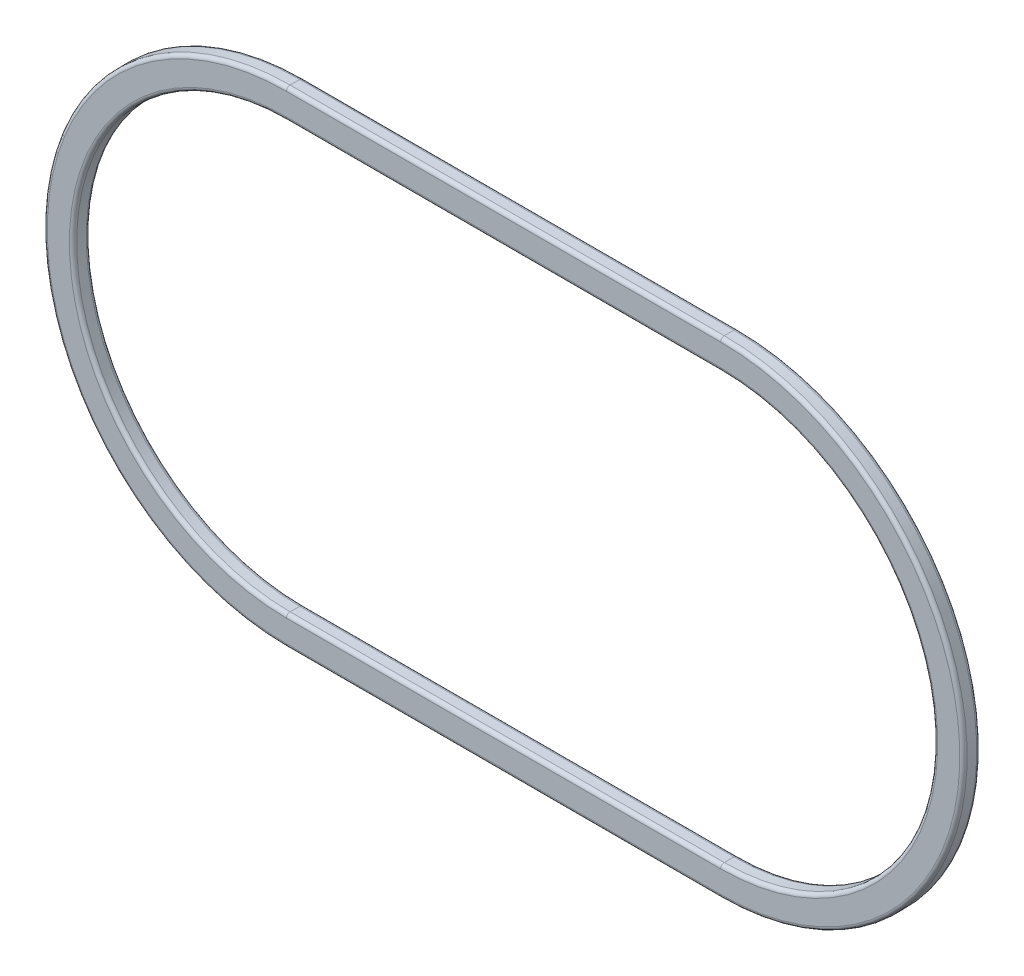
ISO-10303-21;
HEADER;
FILE_DESCRIPTION(('STEP AP214'),'2;1');
FILE_NAME('part.step','',(''),(''),'','','');
FILE_SCHEMA(('AUTOMOTIVE_DESIGN { 1 0 10303 214 1 1 1 1 }'));
ENDSEC;
DATA;
#1=APPLICATION_CONTEXT('core data for automotive mechanical design processes');
#2=APPLICATION_PROTOCOL_DEFINITION('international standard','automotive_design',2000,#1);
#3=PRODUCT_CONTEXT('',#1,'mechanical');
#4=PRODUCT('Part','Part','',(#3));
#5=PRODUCT_RELATED_PRODUCT_CATEGORY('part','',(#4));
#6=PRODUCT_DEFINITION_FORMATION('','',#4);
#7=PRODUCT_DEFINITION_CONTEXT('part definition',#1,'design');
#8=PRODUCT_DEFINITION('design','',#6,#7);
#9=PRODUCT_DEFINITION_SHAPE('','',#8);
#10=(LENGTH_UNIT() NAMED_UNIT(*) SI_UNIT(.MILLI.,.METRE.));
#11=(NAMED_UNIT(*) PLANE_ANGLE_UNIT() SI_UNIT($,.RADIAN.));
#12=(NAMED_UNIT(*) SI_UNIT($,.STERADIAN.) SOLID_ANGLE_UNIT());
#13=UNCERTAINTY_MEASURE_WITH_UNIT(LENGTH_MEASURE(1.E-05),#10,'distance_accuracy_value','');
#14=(GEOMETRIC_REPRESENTATION_CONTEXT(3) GLOBAL_UNCERTAINTY_ASSIGNED_CONTEXT((#13)) GLOBAL_UNIT_ASSIGNED_CONTEXT((#10,
#11,#12)) REPRESENTATION_CONTEXT('',''));
#15=CARTESIAN_POINT('',(0.,0.,0.));
#16=DIRECTION('',(0.,0.,1.));
#17=DIRECTION('',(1.,0.,0.));
#18=AXIS2_PLACEMENT_3D('',#15,#16,#17);
#19=CARTESIAN_POINT('',(0.,0.,0.));
#20=DIRECTION('',(0.,0.,-1.));
#21=DIRECTION('',(-1.,0.,0.));
#22=AXIS2_PLACEMENT_3D('',#19,#20,#21);
#23=CYLINDRICAL_SURFACE('',#22,33.);
#24=DIRECTION('',(0.,0.,1.));
#25=VECTOR('',#24,1.);
#26=CARTESIAN_POINT('',(-4.57966997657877E-13,-33.,3.28352476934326));
#27=LINE('',#26,#25);
#28=CARTESIAN_POINT('',(-4.57966997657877E-13,-33.,1.98352476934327));
#29=VERTEX_POINT('',#28);
#30=CARTESIAN_POINT('',(-4.57966997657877E-13,-33.,3.28352476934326));
#31=VERTEX_POINT('',#30);
#32=EDGE_CURVE('E477',#29,#31,#27,.T.);
#33=ORIENTED_EDGE('',*,*,#32,.T.);
#34=CARTESIAN_POINT('',(0.,0.,3.28352476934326));
#35=DIRECTION('',(0.,0.,-1.));
#36=DIRECTION('',(-1.,0.,0.));
#37=AXIS2_PLACEMENT_3D('',#34,#35,#36);
#38=CIRCLE('',#37,33.);
#39=CARTESIAN_POINT('',(0.,33.,3.28352476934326));
#40=VERTEX_POINT('',#39);
#41=EDGE_CURVE('E46',#31,#40,#38,.T.);
#42=ORIENTED_EDGE('',*,*,#41,.T.);
#43=CARTESIAN_POINT('',(0.,33.,1.98352476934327));
#44=DIRECTION('',(0.,0.,1.));
#45=VECTOR('',#44,1.);
#46=LINE('',#43,#45);
#47=CARTESIAN_POINT('',(4.53925663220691E-13,33.,1.98352476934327));
#48=VERTEX_POINT('',#47);
#49=EDGE_CURVE('E279',#48,#40,#46,.T.);
#50=ORIENTED_EDGE('',*,*,#49,.F.);
#51=CARTESIAN_POINT('',(0.,0.,1.98352476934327));
#52=DIRECTION('',(0.,0.,-1.));
#53=DIRECTION('',(-1.,0.,0.));
#54=AXIS2_PLACEMENT_3D('',#51,#52,#53);
#55=CIRCLE('',#54,33.);
#56=EDGE_CURVE('E11',#29,#48,#55,.T.);
#57=ORIENTED_EDGE('',*,*,#56,.F.);
#58=EDGE_LOOP('',(#33,#42,#50,#57));
#59=FACE_BOUND('',#58,.T.);
#60=ADVANCED_FACE('F37',(#59),#23,.T.);
#61=CARTESIAN_POINT('',(0.,0.,3.28352476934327));
#62=DIRECTION('',(0.,0.,-1.));
#63=DIRECTION('',(-1.,0.,0.));
#64=AXIS2_PLACEMENT_3D('',#61,#62,#63);
#65=TOROIDAL_SURFACE('',#64,32.5,0.5);
#66=CARTESIAN_POINT('',(-4.5102810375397E-13,-32.5,3.28352476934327));
#67=DIRECTION('',(-1.,0.,0.));
#68=DIRECTION('',(0.,0.,1.));
#69=AXIS2_PLACEMENT_3D('',#66,#67,#68);
#70=CIRCLE('',#69,0.5);
#71=CARTESIAN_POINT('',(-4.5102810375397E-13,-32.5,3.78352476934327));
#72=VERTEX_POINT('',#71);
#73=EDGE_CURVE('E483',#31,#72,#70,.T.);
#74=ORIENTED_EDGE('',*,*,#73,.T.);
#75=CARTESIAN_POINT('',(0.,0.,3.78352476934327));
#76=DIRECTION('',(0.,0.,-1.));
#77=DIRECTION('',(-1.,0.,0.));
#78=AXIS2_PLACEMENT_3D('',#75,#76,#77);
#79=CIRCLE('',#78,32.5);
#80=CARTESIAN_POINT('',(0.,32.5,3.78352476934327));
#81=VERTEX_POINT('',#80);
#82=EDGE_CURVE('E296',#72,#81,#79,.T.);
#83=ORIENTED_EDGE('',*,*,#82,.T.);
#84=CARTESIAN_POINT('',(0.,32.5,3.28352476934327));
#85=DIRECTION('',(1.,0.,0.));
#86=DIRECTION('',(0.,1.,0.));
#87=AXIS2_PLACEMENT_3D('',#84,#85,#86);
#88=CIRCLE('',#87,0.5);
#89=EDGE_CURVE('E303',#40,#81,#88,.T.);
#90=ORIENTED_EDGE('',*,*,#89,.F.);
#91=ORIENTED_EDGE('',*,*,#41,.F.);
#92=EDGE_LOOP('',(#74,#83,#90,#91));
#93=FACE_BOUND('',#92,.T.);
#94=ADVANCED_FACE('F308',(#93),#65,.T.);
#95=CARTESIAN_POINT('',(0.,0.,3.28352476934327));
#96=DIRECTION('',(0.,0.,-1.));
#97=DIRECTION('',(-1.,0.,0.));
#98=AXIS2_PLACEMENT_3D('',#95,#96,#97);
#99=TOROIDAL_SURFACE('',#98,29.5,0.5);
#100=CARTESIAN_POINT('',(-4.09394740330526E-13,-29.5,3.28352476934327));
#101=DIRECTION('',(-1.,0.,0.));
#102=DIRECTION('',(0.,0.,1.));
#103=AXIS2_PLACEMENT_3D('',#100,#101,#102);
#104=CIRCLE('',#103,0.5);
#105=CARTESIAN_POINT('',(-4.09394740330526E-13,-29.5,3.78352476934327));
#106=VERTEX_POINT('',#105);
#107=CARTESIAN_POINT('',(-4.02455846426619E-13,-29.,3.28352476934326));
#108=VERTEX_POINT('',#107);
#109=EDGE_CURVE('E490',#106,#108,#104,.T.);
#110=ORIENTED_EDGE('',*,*,#109,.T.);
#111=CARTESIAN_POINT('',(0.,0.,3.28352476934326));
#112=DIRECTION('',(0.,0.,-1.));
#113=DIRECTION('',(-1.,0.,0.));
#114=AXIS2_PLACEMENT_3D('',#111,#112,#113);
#115=CIRCLE('',#114,29.);
#116=CARTESIAN_POINT('',(0.,29.,3.28352476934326));
#117=VERTEX_POINT('',#116);
#118=EDGE_CURVE('E330',#108,#117,#115,.T.);
#119=ORIENTED_EDGE('',*,*,#118,.T.);
#120=CARTESIAN_POINT('',(0.,29.5,3.28352476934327));
#121=DIRECTION('',(1.,0.,0.));
#122=DIRECTION('',(0.,0.,1.));
#123=AXIS2_PLACEMENT_3D('',#120,#121,#122);
#124=CIRCLE('',#123,0.5);
#125=CARTESIAN_POINT('',(0.,29.5,3.78352476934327));
#126=VERTEX_POINT('',#125);
#127=EDGE_CURVE('E443',#126,#117,#124,.T.);
#128=ORIENTED_EDGE('',*,*,#127,.F.);
#129=CARTESIAN_POINT('',(0.,0.,3.78352476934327));
#130=DIRECTION('',(0.,0.,-1.));
#131=DIRECTION('',(-1.,0.,0.));
#132=AXIS2_PLACEMENT_3D('',#129,#130,#131);
#133=CIRCLE('',#132,29.5);
#134=EDGE_CURVE('E338',#106,#126,#133,.T.);
#135=ORIENTED_EDGE('',*,*,#134,.F.);
#136=EDGE_LOOP('',(#110,#119,#128,#135));
#137=FACE_BOUND('',#136,.T.);
#138=ADVANCED_FACE('F317',(#137),#99,.T.);
#139=CARTESIAN_POINT('',(0.,0.,0.));
#140=DIRECTION('',(0.,0.,-1.));
#141=DIRECTION('',(-1.,0.,0.));
#142=AXIS2_PLACEMENT_3D('',#139,#140,#141);
#143=CYLINDRICAL_SURFACE('',#142,29.);
#144=DIRECTION('',(0.,0.,-1.));
#145=VECTOR('',#144,1.);
#146=CARTESIAN_POINT('',(-4.02455846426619E-13,-29.,3.28352476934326));
#147=LINE('',#146,#145);
#148=CARTESIAN_POINT('',(-4.02455846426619E-13,-29.,1.98352476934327));
#149=VERTEX_POINT('',#148);
#150=EDGE_CURVE('E511',#108,#149,#147,.T.);
#151=ORIENTED_EDGE('',*,*,#150,.T.);
#152=CARTESIAN_POINT('',(0.,0.,1.98352476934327));
#153=DIRECTION('',(0.,0.,-1.));
#154=DIRECTION('',(-1.,0.,0.));
#155=AXIS2_PLACEMENT_3D('',#152,#153,#154);
#156=CIRCLE('',#155,29.);
#157=CARTESIAN_POINT('',(0.,29.,1.98352476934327));
#158=VERTEX_POINT('',#157);
#159=EDGE_CURVE('E339',#149,#158,#156,.T.);
#160=ORIENTED_EDGE('',*,*,#159,.T.);
#161=CARTESIAN_POINT('',(0.,29.,3.28352476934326));
#162=DIRECTION('',(0.,0.,-1.));
#163=VECTOR('',#162,1.);
#164=LINE('',#161,#163);
#165=EDGE_CURVE('E346',#117,#158,#164,.T.);
#166=ORIENTED_EDGE('',*,*,#165,.F.);
#167=ORIENTED_EDGE('',*,*,#118,.F.);
#168=EDGE_LOOP('',(#151,#160,#166,#167));
#169=FACE_BOUND('',#168,.T.);
#170=ADVANCED_FACE('F320',(#169),#143,.F.);
#171=CARTESIAN_POINT('',(0.,0.,1.98352476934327));
#172=DIRECTION('',(0.,0.,-1.));
#173=DIRECTION('',(-1.,0.,0.));
#174=AXIS2_PLACEMENT_3D('',#171,#172,#173);
#175=TOROIDAL_SURFACE('',#174,29.5,0.5);
#176=CARTESIAN_POINT('',(-4.09394740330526E-13,-29.5,1.98352476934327));
#177=DIRECTION('',(-1.,0.,0.));
#178=DIRECTION('',(0.,0.,1.));
#179=AXIS2_PLACEMENT_3D('',#176,#177,#178);
#180=CIRCLE('',#179,0.5);
#181=CARTESIAN_POINT('',(-4.09394740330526E-13,-29.5,1.48352476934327));
#182=VERTEX_POINT('',#181);
#183=EDGE_CURVE('E372',#149,#182,#180,.T.);
#184=ORIENTED_EDGE('',*,*,#183,.T.);
#185=CARTESIAN_POINT('',(0.,0.,1.48352476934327));
#186=DIRECTION('',(0.,0.,-1.));
#187=DIRECTION('',(-1.,0.,0.));
#188=AXIS2_PLACEMENT_3D('',#185,#186,#187);
#189=CIRCLE('',#188,29.5);
#190=CARTESIAN_POINT('',(0.,29.5,1.48352476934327));
#191=VERTEX_POINT('',#190);
#192=EDGE_CURVE('E278',#182,#191,#189,.T.);
#193=ORIENTED_EDGE('',*,*,#192,.T.);
#194=CARTESIAN_POINT('',(0.,29.5,1.98352476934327));
#195=DIRECTION('',(1.,0.,0.));
#196=DIRECTION('',(0.,-1.,0.));
#197=AXIS2_PLACEMENT_3D('',#194,#195,#196);
#198=CIRCLE('',#197,0.5);
#199=EDGE_CURVE('E362',#158,#191,#198,.T.);
#200=ORIENTED_EDGE('',*,*,#199,.F.);
#201=ORIENTED_EDGE('',*,*,#159,.F.);
#202=EDGE_LOOP('',(#184,#193,#200,#201));
#203=FACE_BOUND('',#202,.T.);
#204=ADVANCED_FACE('F263',(#203),#175,.T.);
#205=CARTESIAN_POINT('',(0.,0.,1.98352476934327));
#206=DIRECTION('',(0.,0.,-1.));
#207=DIRECTION('',(-1.,0.,0.));
#208=AXIS2_PLACEMENT_3D('',#205,#206,#207);
#209=TOROIDAL_SURFACE('',#208,32.5,0.5);
#210=CARTESIAN_POINT('',(-4.5102810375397E-13,-32.5,1.98352476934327));
#211=DIRECTION('',(-1.,0.,0.));
#212=DIRECTION('',(0.,0.,-1.));
#213=AXIS2_PLACEMENT_3D('',#210,#211,#212);
#214=CIRCLE('',#213,0.5);
#215=CARTESIAN_POINT('',(-4.5102810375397E-13,-32.5,1.48352476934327));
#216=VERTEX_POINT('',#215);
#217=EDGE_CURVE('E165',#216,#29,#214,.T.);
#218=ORIENTED_EDGE('',*,*,#217,.T.);
#219=ORIENTED_EDGE('',*,*,#56,.T.);
#220=CARTESIAN_POINT('',(0.,32.5,1.98352476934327));
#221=DIRECTION('',(1.,0.,0.));
#222=DIRECTION('',(0.,0.,-1.));
#223=AXIS2_PLACEMENT_3D('',#220,#221,#222);
#224=CIRCLE('',#223,0.5);
#225=CARTESIAN_POINT('',(4.47048001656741E-13,32.5,1.48352476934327));
#226=VERTEX_POINT('',#225);
#227=EDGE_CURVE('E54',#226,#48,#224,.T.);
#228=ORIENTED_EDGE('',*,*,#227,.F.);
#229=CARTESIAN_POINT('',(0.,0.,1.48352476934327));
#230=DIRECTION('',(0.,0.,-1.));
#231=DIRECTION('',(-1.,0.,0.));
#232=AXIS2_PLACEMENT_3D('',#229,#230,#231);
#233=CIRCLE('',#232,32.5);
#234=EDGE_CURVE('E271',#216,#226,#233,.T.);
#235=ORIENTED_EDGE('',*,*,#234,.F.);
#236=EDGE_LOOP('',(#218,#219,#228,#235));
#237=FACE_BOUND('',#236,.T.);
#238=ADVANCED_FACE('F258',(#237),#209,.T.);
#239=CARTESIAN_POINT('',(58.9999999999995,-33.,3.28352476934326));
#240=DIRECTION('',(0.,-1.,0.));
#241=DIRECTION('',(0.,0.,-1.));
#242=AXIS2_PLACEMENT_3D('',#239,#240,#241);
#243=PLANE('',#242);
#244=DIRECTION('',(0.,0.,1.));
#245=VECTOR('',#244,1.);
#246=CARTESIAN_POINT('',(58.9999999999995,-33.,3.28352476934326));
#247=LINE('',#246,#245);
#248=CARTESIAN_POINT('',(58.9999999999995,-33.,1.98352476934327));
#249=VERTEX_POINT('',#248);
#250=CARTESIAN_POINT('',(58.9999999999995,-33.,3.28352476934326));
#251=VERTEX_POINT('',#250);
#252=EDGE_CURVE('E162',#249,#251,#247,.T.);
#253=ORIENTED_EDGE('',*,*,#252,.T.);
#254=DIRECTION('',(-1.,0.,0.));
#255=VECTOR('',#254,1.);
#256=CARTESIAN_POINT('',(58.9999999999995,-33.,3.28352476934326));
#257=LINE('',#256,#255);
#258=EDGE_CURVE('E488',#251,#31,#257,.T.);
#259=ORIENTED_EDGE('',*,*,#258,.T.);
#260=ORIENTED_EDGE('',*,*,#32,.F.);
#261=DIRECTION('',(-1.,0.,0.));
#262=VECTOR('',#261,1.);
#263=CARTESIAN_POINT('',(58.9999999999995,-33.,1.98352476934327));
#264=LINE('',#263,#262);
#265=EDGE_CURVE('E493',#249,#29,#264,.T.);
#266=ORIENTED_EDGE('',*,*,#265,.F.);
#267=EDGE_LOOP('',(#253,#259,#260,#266));
#268=FACE_BOUND('',#267,.T.);
#269=ADVANCED_FACE('F254',(#268),#243,.T.);
#270=CARTESIAN_POINT('',(58.9999999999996,-32.5,3.28352476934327));
#271=DIRECTION('',(-1.,0.,0.));
#272=DIRECTION('',(0.,-1.,0.));
#273=AXIS2_PLACEMENT_3D('',#270,#271,#272);
#274=CYLINDRICAL_SURFACE('',#273,0.5);
#275=CARTESIAN_POINT('',(58.9999999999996,-32.5,3.28352476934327));
#276=DIRECTION('',(-1.,0.,0.));
#277=DIRECTION('',(0.,0.,1.));
#278=AXIS2_PLACEMENT_3D('',#275,#276,#277);
#279=CIRCLE('',#278,0.5);
#280=CARTESIAN_POINT('',(58.9999999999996,-32.5,3.78352476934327));
#281=VERTEX_POINT('',#280);
#282=EDGE_CURVE('E532',#251,#281,#279,.T.);
#283=ORIENTED_EDGE('',*,*,#282,.T.);
#284=DIRECTION('',(-1.,0.,0.));
#285=VECTOR('',#284,1.);
#286=CARTESIAN_POINT('',(58.9999999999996,-32.5,3.78352476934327));
#287=LINE('',#286,#285);
#288=EDGE_CURVE('E489',#281,#72,#287,.T.);
#289=ORIENTED_EDGE('',*,*,#288,.T.);
#290=ORIENTED_EDGE('',*,*,#73,.F.);
#291=ORIENTED_EDGE('',*,*,#258,.F.);
#292=EDGE_LOOP('',(#283,#289,#290,#291));
#293=FACE_BOUND('',#292,.T.);
#294=ADVANCED_FACE('F250',(#293),#274,.T.);
#295=CARTESIAN_POINT('',(58.9999999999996,-29.5,3.28352476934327));
#296=DIRECTION('',(-1.,0.,0.));
#297=DIRECTION('',(0.,-1.,0.));
#298=AXIS2_PLACEMENT_3D('',#295,#296,#297);
#299=CYLINDRICAL_SURFACE('',#298,0.5);
#300=CARTESIAN_POINT('',(58.9999999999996,-29.5,3.28352476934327));
#301=DIRECTION('',(-1.,0.,0.));
#302=DIRECTION('',(0.,0.,1.));
#303=AXIS2_PLACEMENT_3D('',#300,#301,#302);
#304=CIRCLE('',#303,0.5);
#305=CARTESIAN_POINT('',(58.9999999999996,-29.5,3.78352476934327));
#306=VERTEX_POINT('',#305);
#307=CARTESIAN_POINT('',(58.9999999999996,-29.,3.28352476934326));
#308=VERTEX_POINT('',#307);
#309=EDGE_CURVE('E534',#306,#308,#304,.T.);
#310=ORIENTED_EDGE('',*,*,#309,.T.);
#311=DIRECTION('',(-1.,0.,0.));
#312=VECTOR('',#311,1.);
#313=CARTESIAN_POINT('',(58.9999999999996,-29.,3.28352476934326));
#314=LINE('',#313,#312);
#315=EDGE_CURVE('E500',#308,#108,#314,.T.);
#316=ORIENTED_EDGE('',*,*,#315,.T.);
#317=ORIENTED_EDGE('',*,*,#109,.F.);
#318=DIRECTION('',(-1.,0.,0.));
#319=VECTOR('',#318,1.);
#320=CARTESIAN_POINT('',(58.9999999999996,-29.5,3.78352476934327));
#321=LINE('',#320,#319);
#322=EDGE_CURVE('E495',#306,#106,#321,.T.);
#323=ORIENTED_EDGE('',*,*,#322,.F.);
#324=EDGE_LOOP('',(#310,#316,#317,#323));
#325=FACE_BOUND('',#324,.T.);
#326=ADVANCED_FACE('F246',(#325),#299,.T.);
#327=CARTESIAN_POINT('',(58.9999999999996,-29.,3.28352476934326));
#328=DIRECTION('',(0.,1.,0.));
#329=DIRECTION('',(-1.,0.,0.));
#330=AXIS2_PLACEMENT_3D('',#327,#328,#329);
#331=PLANE('',#330);
#332=DIRECTION('',(0.,0.,-1.));
#333=VECTOR('',#332,1.);
#334=CARTESIAN_POINT('',(58.9999999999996,-29.,3.28352476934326));
#335=LINE('',#334,#333);
#336=CARTESIAN_POINT('',(58.9999999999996,-29.,1.98352476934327));
#337=VERTEX_POINT('',#336);
#338=EDGE_CURVE('E537',#308,#337,#335,.T.);
#339=ORIENTED_EDGE('',*,*,#338,.T.);
#340=DIRECTION('',(-1.,0.,0.));
#341=VECTOR('',#340,1.);
#342=CARTESIAN_POINT('',(58.9999999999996,-29.,1.98352476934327));
#343=LINE('',#342,#341);
#344=EDGE_CURVE('E503',#337,#149,#343,.T.);
#345=ORIENTED_EDGE('',*,*,#344,.T.);
#346=ORIENTED_EDGE('',*,*,#150,.F.);
#347=ORIENTED_EDGE('',*,*,#315,.F.);
#348=EDGE_LOOP('',(#339,#345,#346,#347));
#349=FACE_BOUND('',#348,.T.);
#350=ADVANCED_FACE('F242',(#349),#331,.T.);
#351=CARTESIAN_POINT('',(58.9999999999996,-29.5,1.98352476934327));
#352=DIRECTION('',(-1.,0.,0.));
#353=DIRECTION('',(0.,-1.,0.));
#354=AXIS2_PLACEMENT_3D('',#351,#352,#353);
#355=CYLINDRICAL_SURFACE('',#354,0.5);
#356=CARTESIAN_POINT('',(58.9999999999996,-29.5,1.98352476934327));
#357=DIRECTION('',(-1.,0.,0.));
#358=DIRECTION('',(0.,0.,1.));
#359=AXIS2_PLACEMENT_3D('',#356,#357,#358);
#360=CIRCLE('',#359,0.5);
#361=CARTESIAN_POINT('',(58.9999999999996,-29.5,1.48352476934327));
#362=VERTEX_POINT('',#361);
#363=EDGE_CURVE('E188',#337,#362,#360,.T.);
#364=ORIENTED_EDGE('',*,*,#363,.T.);
#365=DIRECTION('',(-1.,0.,0.));
#366=VECTOR('',#365,1.);
#367=CARTESIAN_POINT('',(58.9999999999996,-29.5,1.48352476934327));
#368=LINE('',#367,#366);
#369=EDGE_CURVE('E377',#362,#182,#368,.T.);
#370=ORIENTED_EDGE('',*,*,#369,.T.);
#371=ORIENTED_EDGE('',*,*,#183,.F.);
#372=ORIENTED_EDGE('',*,*,#344,.F.);
#373=EDGE_LOOP('',(#364,#370,#371,#372));
#374=FACE_BOUND('',#373,.T.);
#375=ADVANCED_FACE('F238',(#374),#355,.T.);
#376=CARTESIAN_POINT('',(58.9999999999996,-32.5,1.98352476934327));
#377=DIRECTION('',(-1.,0.,0.));
#378=DIRECTION('',(0.,-1.,0.));
#379=AXIS2_PLACEMENT_3D('',#376,#377,#378);
#380=CYLINDRICAL_SURFACE('',#379,0.5);
#381=CARTESIAN_POINT('',(58.9999999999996,-32.5,1.98352476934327));
#382=DIRECTION('',(-1.,0.,0.));
#383=DIRECTION('',(0.,0.,-1.));
#384=AXIS2_PLACEMENT_3D('',#381,#382,#383);
#385=CIRCLE('',#384,0.5);
#386=CARTESIAN_POINT('',(58.9999999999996,-32.5,1.48352476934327));
#387=VERTEX_POINT('',#386);
#388=EDGE_CURVE('E185',#387,#249,#385,.T.);
#389=ORIENTED_EDGE('',*,*,#388,.T.);
#390=ORIENTED_EDGE('',*,*,#265,.T.);
#391=ORIENTED_EDGE('',*,*,#217,.F.);
#392=DIRECTION('',(-1.,0.,0.));
#393=VECTOR('',#392,1.);
#394=CARTESIAN_POINT('',(58.9999999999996,-32.5,1.48352476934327));
#395=LINE('',#394,#393);
#396=EDGE_CURVE('E482',#387,#216,#395,.T.);
#397=ORIENTED_EDGE('',*,*,#396,.F.);
#398=EDGE_LOOP('',(#389,#390,#391,#397));
#399=FACE_BOUND('',#398,.T.);
#400=ADVANCED_FACE('F235',(#399),#380,.T.);
#401=CARTESIAN_POINT('',(59.,0.,0.));
#402=DIRECTION('',(0.,0.,-1.));
#403=DIRECTION('',(-1.,0.,0.));
#404=AXIS2_PLACEMENT_3D('',#401,#402,#403);
#405=CYLINDRICAL_SURFACE('',#404,33.);
#406=DIRECTION('',(0.,0.,1.));
#407=VECTOR('',#406,1.);
#408=CARTESIAN_POINT('',(59.,33.,3.28352476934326));
#409=LINE('',#408,#407);
#410=CARTESIAN_POINT('',(59.,33.,1.98352476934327));
#411=VERTEX_POINT('',#410);
#412=CARTESIAN_POINT('',(59.,33.,3.28352476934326));
#413=VERTEX_POINT('',#412);
#414=EDGE_CURVE('E159',#411,#413,#409,.T.);
#415=ORIENTED_EDGE('',*,*,#414,.T.);
#416=CARTESIAN_POINT('',(59.,0.,3.28352476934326));
#417=DIRECTION('',(0.,0.,-1.));
#418=DIRECTION('',(-1.,0.,0.));
#419=AXIS2_PLACEMENT_3D('',#416,#417,#418);
#420=CIRCLE('',#419,33.);
#421=EDGE_CURVE('E166',#413,#251,#420,.T.);
#422=ORIENTED_EDGE('',*,*,#421,.T.);
#423=ORIENTED_EDGE('',*,*,#252,.F.);
#424=CARTESIAN_POINT('',(59.,0.,1.98352476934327));
#425=DIRECTION('',(0.,0.,-1.));
#426=DIRECTION('',(-1.,0.,0.));
#427=AXIS2_PLACEMENT_3D('',#424,#425,#426);
#428=CIRCLE('',#427,33.);
#429=EDGE_CURVE('E154',#411,#249,#428,.T.);
#430=ORIENTED_EDGE('',*,*,#429,.F.);
#431=EDGE_LOOP('',(#415,#422,#423,#430));
#432=FACE_BOUND('',#431,.T.);
#433=ADVANCED_FACE('F156',(#432),#405,.T.);
#434=CARTESIAN_POINT('',(59.,0.,3.28352476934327));
#435=DIRECTION('',(0.,0.,-1.));
#436=DIRECTION('',(-1.,0.,0.));
#437=AXIS2_PLACEMENT_3D('',#434,#435,#436);
#438=TOROIDAL_SURFACE('',#437,32.5,0.5);
#439=CARTESIAN_POINT('',(59.,32.5,3.28352476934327));
#440=DIRECTION('',(1.,0.,0.));
#441=DIRECTION('',(0.,0.,1.));
#442=AXIS2_PLACEMENT_3D('',#439,#440,#441);
#443=CIRCLE('',#442,0.5);
#444=CARTESIAN_POINT('',(59.,32.5,3.78352476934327));
#445=VERTEX_POINT('',#444);
#446=EDGE_CURVE('E182',#413,#445,#443,.T.);
#447=ORIENTED_EDGE('',*,*,#446,.T.);
#448=CARTESIAN_POINT('',(59.,0.,3.78352476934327));
#449=DIRECTION('',(0.,0.,-1.));
#450=DIRECTION('',(-1.,0.,0.));
#451=AXIS2_PLACEMENT_3D('',#448,#449,#450);
#452=CIRCLE('',#451,32.5);
#453=EDGE_CURVE('E517',#445,#281,#452,.T.);
#454=ORIENTED_EDGE('',*,*,#453,.T.);
#455=ORIENTED_EDGE('',*,*,#282,.F.);
#456=ORIENTED_EDGE('',*,*,#421,.F.);
#457=EDGE_LOOP('',(#447,#454,#455,#456));
#458=FACE_BOUND('',#457,.T.);
#459=ADVANCED_FACE('F228',(#458),#438,.T.);
#460=CARTESIAN_POINT('',(59.,0.,3.28352476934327));
#461=DIRECTION('',(0.,0.,-1.));
#462=DIRECTION('',(-1.,0.,0.));
#463=AXIS2_PLACEMENT_3D('',#460,#461,#462);
#464=TOROIDAL_SURFACE('',#463,29.5,0.5);
#465=CARTESIAN_POINT('',(59.,29.5,3.28352476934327));
#466=DIRECTION('',(1.,0.,0.));
#467=DIRECTION('',(0.,0.,1.));
#468=AXIS2_PLACEMENT_3D('',#465,#466,#467);
#469=CIRCLE('',#468,0.5);
#470=CARTESIAN_POINT('',(59.,29.5,3.78352476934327));
#471=VERTEX_POINT('',#470);
#472=CARTESIAN_POINT('',(59.,29.,3.28352476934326));
#473=VERTEX_POINT('',#472);
#474=EDGE_CURVE('E545',#471,#473,#469,.T.);
#475=ORIENTED_EDGE('',*,*,#474,.T.);
#476=CARTESIAN_POINT('',(59.,0.,3.28352476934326));
#477=DIRECTION('',(0.,0.,-1.));
#478=DIRECTION('',(-1.,0.,0.));
#479=AXIS2_PLACEMENT_3D('',#476,#477,#478);
#480=CIRCLE('',#479,29.);
#481=EDGE_CURVE('E523',#473,#308,#480,.T.);
#482=ORIENTED_EDGE('',*,*,#481,.T.);
#483=ORIENTED_EDGE('',*,*,#309,.F.);
#484=CARTESIAN_POINT('',(59.,0.,3.78352476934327));
#485=DIRECTION('',(0.,0.,-1.));
#486=DIRECTION('',(-1.,0.,0.));
#487=AXIS2_PLACEMENT_3D('',#484,#485,#486);
#488=CIRCLE('',#487,29.5);
#489=EDGE_CURVE('E520',#471,#306,#488,.T.);
#490=ORIENTED_EDGE('',*,*,#489,.F.);
#491=EDGE_LOOP('',(#475,#482,#483,#490));
#492=FACE_BOUND('',#491,.T.);
#493=ADVANCED_FACE('F224',(#492),#464,.T.);
#494=CARTESIAN_POINT('',(59.,0.,0.));
#495=DIRECTION('',(0.,0.,-1.));
#496=DIRECTION('',(-1.,0.,0.));
#497=AXIS2_PLACEMENT_3D('',#494,#495,#496);
#498=CYLINDRICAL_SURFACE('',#497,29.);
#499=DIRECTION('',(0.,0.,-1.));
#500=VECTOR('',#499,1.);
#501=CARTESIAN_POINT('',(59.,29.,3.28352476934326));
#502=LINE('',#501,#500);
#503=CARTESIAN_POINT('',(59.,29.,1.98352476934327));
#504=VERTEX_POINT('',#503);
#505=EDGE_CURVE('E542',#473,#504,#502,.T.);
#506=ORIENTED_EDGE('',*,*,#505,.T.);
#507=CARTESIAN_POINT('',(59.,0.,1.98352476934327));
#508=DIRECTION('',(0.,0.,-1.));
#509=DIRECTION('',(-1.,0.,0.));
#510=AXIS2_PLACEMENT_3D('',#507,#508,#509);
#511=CIRCLE('',#510,29.);
#512=EDGE_CURVE('E526',#504,#337,#511,.T.);
#513=ORIENTED_EDGE('',*,*,#512,.T.);
#514=ORIENTED_EDGE('',*,*,#338,.F.);
#515=ORIENTED_EDGE('',*,*,#481,.F.);
#516=EDGE_LOOP('',(#506,#513,#514,#515));
#517=FACE_BOUND('',#516,.T.);
#518=ADVANCED_FACE('F220',(#517),#498,.F.);
#519=CARTESIAN_POINT('',(59.,0.,1.98352476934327));
#520=DIRECTION('',(0.,0.,-1.));
#521=DIRECTION('',(-1.,0.,0.));
#522=AXIS2_PLACEMENT_3D('',#519,#520,#521);
#523=TOROIDAL_SURFACE('',#522,29.5,0.5);
#524=CARTESIAN_POINT('',(59.,29.5,1.98352476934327));
#525=DIRECTION('',(1.,0.,0.));
#526=DIRECTION('',(0.,0.,1.));
#527=AXIS2_PLACEMENT_3D('',#524,#525,#526);
#528=CIRCLE('',#527,0.5);
#529=CARTESIAN_POINT('',(59.,29.5,1.48352476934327));
#530=VERTEX_POINT('',#529);
#531=EDGE_CURVE('E390',#504,#530,#528,.T.);
#532=ORIENTED_EDGE('',*,*,#531,.T.);
#533=CARTESIAN_POINT('',(59.,0.,1.48352476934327));
#534=DIRECTION('',(0.,0.,-1.));
#535=DIRECTION('',(-1.,0.,0.));
#536=AXIS2_PLACEMENT_3D('',#533,#534,#535);
#537=CIRCLE('',#536,29.5);
#538=EDGE_CURVE('E382',#530,#362,#537,.T.);
#539=ORIENTED_EDGE('',*,*,#538,.T.);
#540=ORIENTED_EDGE('',*,*,#363,.F.);
#541=ORIENTED_EDGE('',*,*,#512,.F.);
#542=EDGE_LOOP('',(#532,#539,#540,#541));
#543=FACE_BOUND('',#542,.T.);
#544=ADVANCED_FACE('F217',(#543),#523,.T.);
#545=CARTESIAN_POINT('',(59.,0.,1.98352476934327));
#546=DIRECTION('',(0.,0.,-1.));
#547=DIRECTION('',(-1.,0.,0.));
#548=AXIS2_PLACEMENT_3D('',#545,#546,#547);
#549=TOROIDAL_SURFACE('',#548,32.5,0.5);
#550=CARTESIAN_POINT('',(59.,32.5,1.98352476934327));
#551=DIRECTION('',(1.,0.,0.));
#552=DIRECTION('',(0.,0.,-1.));
#553=AXIS2_PLACEMENT_3D('',#550,#551,#552);
#554=CIRCLE('',#553,0.5);
#555=CARTESIAN_POINT('',(59.,32.5,1.48352476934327));
#556=VERTEX_POINT('',#555);
#557=EDGE_CURVE('E169',#556,#411,#554,.T.);
#558=ORIENTED_EDGE('',*,*,#557,.T.);
#559=ORIENTED_EDGE('',*,*,#429,.T.);
#560=ORIENTED_EDGE('',*,*,#388,.F.);
#561=CARTESIAN_POINT('',(59.,0.,1.48352476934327));
#562=DIRECTION('',(0.,0.,-1.));
#563=DIRECTION('',(-1.,0.,0.));
#564=AXIS2_PLACEMENT_3D('',#561,#562,#563);
#565=CIRCLE('',#564,32.5);
#566=EDGE_CURVE('E172',#556,#387,#565,.T.);
#567=ORIENTED_EDGE('',*,*,#566,.F.);
#568=EDGE_LOOP('',(#558,#559,#560,#567));
#569=FACE_BOUND('',#568,.T.);
#570=ADVANCED_FACE('F170',(#569),#549,.T.);
#571=CARTESIAN_POINT('',(59.,32.5,1.98352476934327));
#572=DIRECTION('',(-1.,0.,0.));
#573=DIRECTION('',(0.,-1.,0.));
#574=AXIS2_PLACEMENT_3D('',#571,#572,#573);
#575=CYLINDRICAL_SURFACE('',#574,0.5);
#576=ORIENTED_EDGE('',*,*,#227,.T.);
#577=DIRECTION('',(-1.,0.,0.));
#578=VECTOR('',#577,1.);
#579=CARTESIAN_POINT('',(59.,33.,1.98352476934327));
#580=LINE('',#579,#578);
#581=EDGE_CURVE('E177',#411,#48,#580,.T.);
#582=ORIENTED_EDGE('',*,*,#581,.F.);
#583=ORIENTED_EDGE('',*,*,#557,.F.);
#584=DIRECTION('',(-1.,0.,0.));
#585=VECTOR('',#584,1.);
#586=CARTESIAN_POINT('',(59.,32.5,1.48352476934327));
#587=LINE('',#586,#585);
#588=EDGE_CURVE('E202',#556,#226,#587,.T.);
#589=ORIENTED_EDGE('',*,*,#588,.T.);
#590=EDGE_LOOP('',(#576,#582,#583,#589));
#591=FACE_BOUND('',#590,.T.);
#592=ADVANCED_FACE('F184',(#591),#575,.T.);
#593=CARTESIAN_POINT('',(59.,33.,3.28352476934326));
#594=DIRECTION('',(0.,-1.,0.));
#595=DIRECTION('',(0.,0.,-1.));
#596=AXIS2_PLACEMENT_3D('',#593,#594,#595);
#597=PLANE('',#596);
#598=ORIENTED_EDGE('',*,*,#49,.T.);
#599=DIRECTION('',(-1.,0.,0.));
#600=VECTOR('',#599,1.);
#601=CARTESIAN_POINT('',(59.,33.,3.28352476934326));
#602=LINE('',#601,#600);
#603=EDGE_CURVE('E180',#413,#40,#602,.T.);
#604=ORIENTED_EDGE('',*,*,#603,.F.);
#605=ORIENTED_EDGE('',*,*,#414,.F.);
#606=ORIENTED_EDGE('',*,*,#581,.T.);
#607=EDGE_LOOP('',(#598,#604,#605,#606));
#608=FACE_BOUND('',#607,.T.);
#609=ADVANCED_FACE('F176',(#608),#597,.F.);
#610=CARTESIAN_POINT('',(59.,32.5,3.28352476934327));
#611=DIRECTION('',(-1.,0.,0.));
#612=DIRECTION('',(0.,-1.,0.));
#613=AXIS2_PLACEMENT_3D('',#610,#611,#612);
#614=CYLINDRICAL_SURFACE('',#613,0.5);
#615=ORIENTED_EDGE('',*,*,#89,.T.);
#616=DIRECTION('',(-1.,0.,0.));
#617=VECTOR('',#616,1.);
#618=CARTESIAN_POINT('',(59.,32.5,3.78352476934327));
#619=LINE('',#618,#617);
#620=EDGE_CURVE('E190',#445,#81,#619,.T.);
#621=ORIENTED_EDGE('',*,*,#620,.F.);
#622=ORIENTED_EDGE('',*,*,#446,.F.);
#623=ORIENTED_EDGE('',*,*,#603,.T.);
#624=EDGE_LOOP('',(#615,#621,#622,#623));
#625=FACE_BOUND('',#624,.T.);
#626=ADVANCED_FACE('F455',(#625),#614,.T.);
#627=CARTESIAN_POINT('',(59.,29.5,3.78352476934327));
#628=DIRECTION('',(0.,0.,-1.));
#629=DIRECTION('',(0.,1.,0.));
#630=AXIS2_PLACEMENT_3D('',#627,#628,#629);
#631=PLANE('',#630);
#632=DIRECTION('',(-1.,0.,0.));
#633=VECTOR('',#632,1.);
#634=CARTESIAN_POINT('',(59.,29.5,3.78352476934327));
#635=LINE('',#634,#633);
#636=EDGE_CURVE('E431',#471,#126,#635,.T.);
#637=ORIENTED_EDGE('',*,*,#636,.F.);
#638=ORIENTED_EDGE('',*,*,#489,.T.);
#639=ORIENTED_EDGE('',*,*,#322,.T.);
#640=ORIENTED_EDGE('',*,*,#134,.T.);
#641=EDGE_LOOP('',(#637,#638,#639,#640));
#642=FACE_BOUND('',#641,.T.);
#643=ORIENTED_EDGE('',*,*,#620,.T.);
#644=ORIENTED_EDGE('',*,*,#82,.F.);
#645=ORIENTED_EDGE('',*,*,#288,.F.);
#646=ORIENTED_EDGE('',*,*,#453,.F.);
#647=EDGE_LOOP('',(#643,#644,#645,#646));
#648=FACE_BOUND('',#647,.T.);
#649=ADVANCED_FACE('F463',(#642,#648),#631,.F.);
#650=CARTESIAN_POINT('',(59.,29.5,3.28352476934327));
#651=DIRECTION('',(-1.,0.,0.));
#652=DIRECTION('',(0.,-1.,0.));
#653=AXIS2_PLACEMENT_3D('',#650,#651,#652);
#654=CYLINDRICAL_SURFACE('',#653,0.5);
#655=ORIENTED_EDGE('',*,*,#127,.T.);
#656=DIRECTION('',(-1.,0.,0.));
#657=VECTOR('',#656,1.);
#658=CARTESIAN_POINT('',(59.,29.,3.28352476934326));
#659=LINE('',#658,#657);
#660=EDGE_CURVE('E388',#473,#117,#659,.T.);
#661=ORIENTED_EDGE('',*,*,#660,.F.);
#662=ORIENTED_EDGE('',*,*,#474,.F.);
#663=ORIENTED_EDGE('',*,*,#636,.T.);
#664=EDGE_LOOP('',(#655,#661,#662,#663));
#665=FACE_BOUND('',#664,.T.);
#666=ADVANCED_FACE('F411',(#665),#654,.T.);
#667=CARTESIAN_POINT('',(59.,29.,3.28352476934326));
#668=DIRECTION('',(0.,1.,0.));
#669=DIRECTION('',(-1.,0.,0.));
#670=AXIS2_PLACEMENT_3D('',#667,#668,#669);
#671=PLANE('',#670);
#672=ORIENTED_EDGE('',*,*,#165,.T.);
#673=DIRECTION('',(-1.,0.,0.));
#674=VECTOR('',#673,1.);
#675=CARTESIAN_POINT('',(59.,29.,1.98352476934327));
#676=LINE('',#675,#674);
#677=EDGE_CURVE('E386',#504,#158,#676,.T.);
#678=ORIENTED_EDGE('',*,*,#677,.F.);
#679=ORIENTED_EDGE('',*,*,#505,.F.);
#680=ORIENTED_EDGE('',*,*,#660,.T.);
#681=EDGE_LOOP('',(#672,#678,#679,#680));
#682=FACE_BOUND('',#681,.T.);
#683=ADVANCED_FACE('F407',(#682),#671,.F.);
#684=CARTESIAN_POINT('',(59.,29.5,1.98352476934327));
#685=DIRECTION('',(-1.,0.,0.));
#686=DIRECTION('',(0.,-1.,0.));
#687=AXIS2_PLACEMENT_3D('',#684,#685,#686);
#688=CYLINDRICAL_SURFACE('',#687,0.5);
#689=ORIENTED_EDGE('',*,*,#199,.T.);
#690=DIRECTION('',(-1.,0.,0.));
#691=VECTOR('',#690,1.);
#692=CARTESIAN_POINT('',(59.,29.5,1.48352476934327));
#693=LINE('',#692,#691);
#694=EDGE_CURVE('E380',#530,#191,#693,.T.);
#695=ORIENTED_EDGE('',*,*,#694,.F.);
#696=ORIENTED_EDGE('',*,*,#531,.F.);
#697=ORIENTED_EDGE('',*,*,#677,.T.);
#698=EDGE_LOOP('',(#689,#695,#696,#697));
#699=FACE_BOUND('',#698,.T.);
#700=ADVANCED_FACE('F397',(#699),#688,.T.);
#701=CARTESIAN_POINT('',(59.,29.5,1.48352476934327));
#702=DIRECTION('',(0.,0.,1.));
#703=DIRECTION('',(0.,-1.,0.));
#704=AXIS2_PLACEMENT_3D('',#701,#702,#703);
#705=PLANE('',#704);
#706=ORIENTED_EDGE('',*,*,#588,.F.);
#707=ORIENTED_EDGE('',*,*,#566,.T.);
#708=ORIENTED_EDGE('',*,*,#396,.T.);
#709=ORIENTED_EDGE('',*,*,#234,.T.);
#710=EDGE_LOOP('',(#706,#707,#708,#709));
#711=FACE_BOUND('',#710,.T.);
#712=ORIENTED_EDGE('',*,*,#694,.T.);
#713=ORIENTED_EDGE('',*,*,#192,.F.);
#714=ORIENTED_EDGE('',*,*,#369,.F.);
#715=ORIENTED_EDGE('',*,*,#538,.F.);
#716=EDGE_LOOP('',(#712,#713,#714,#715));
#717=FACE_BOUND('',#716,.T.);
#718=ADVANCED_FACE('F376',(#711,#717),#705,.F.);
#719=CLOSED_SHELL('',(#60,#94,#138,#170,#204,#238,#269,#294,#326,#350,#375,#400,#433,#459,#493,
#518,#544,#570,#592,#609,#626,#649,#666,#683,#700,#718));
#720=MANIFOLD_SOLID_BREP('B2',#719);
#721=ADVANCED_BREP_SHAPE_REPRESENTATION('',(#18,#720),#14);
#722=SHAPE_DEFINITION_REPRESENTATION(#9,#721);
ENDSEC;
END-ISO-10303-21;
